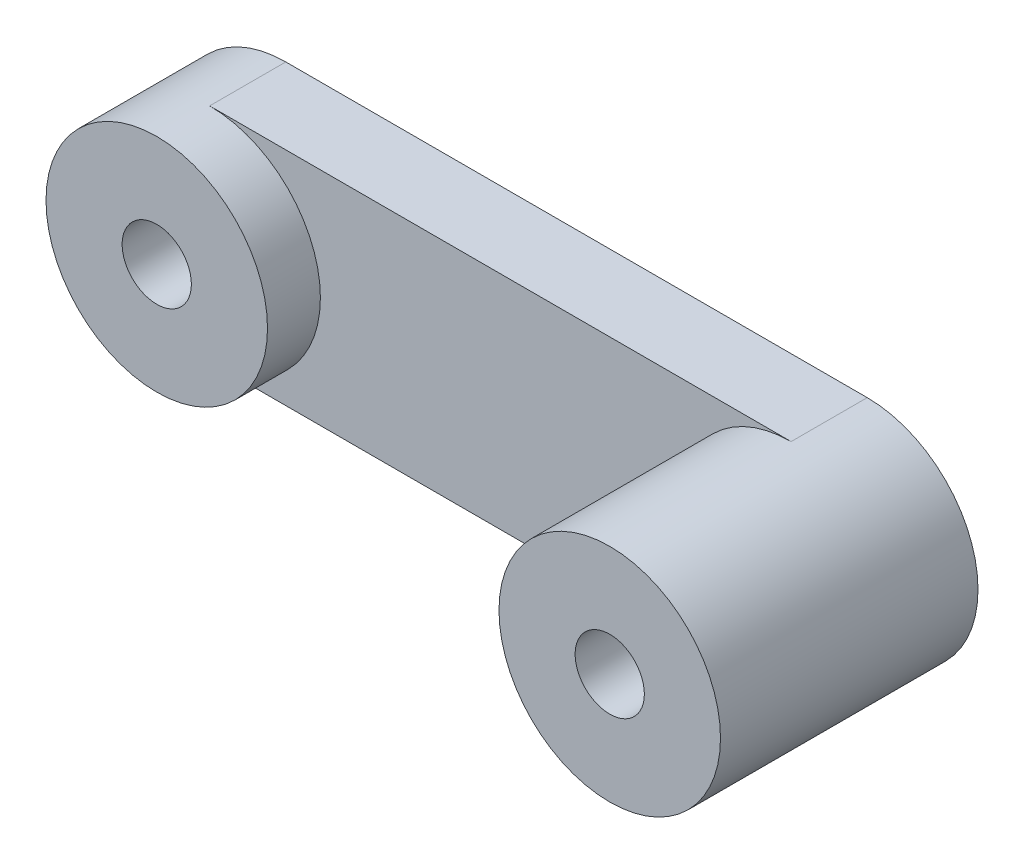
ISO-10303-21;
HEADER;
FILE_DESCRIPTION(('STEP AP214'),'2;1');
FILE_NAME('part.step','',(''),(''),'','','');
FILE_SCHEMA(('AUTOMOTIVE_DESIGN { 1 0 10303 214 1 1 1 1 }'));
ENDSEC;
DATA;
#1=APPLICATION_CONTEXT('core data for automotive mechanical design processes');
#2=APPLICATION_PROTOCOL_DEFINITION('international standard','automotive_design',2000,#1);
#3=PRODUCT_CONTEXT('',#1,'mechanical');
#4=PRODUCT('Part','Part','',(#3));
#5=PRODUCT_RELATED_PRODUCT_CATEGORY('part','',(#4));
#6=PRODUCT_DEFINITION_FORMATION('','',#4);
#7=PRODUCT_DEFINITION_CONTEXT('part definition',#1,'design');
#8=PRODUCT_DEFINITION('design','',#6,#7);
#9=PRODUCT_DEFINITION_SHAPE('','',#8);
#10=(LENGTH_UNIT() NAMED_UNIT(*) SI_UNIT(.MILLI.,.METRE.));
#11=(NAMED_UNIT(*) PLANE_ANGLE_UNIT() SI_UNIT($,.RADIAN.));
#12=(NAMED_UNIT(*) SI_UNIT($,.STERADIAN.) SOLID_ANGLE_UNIT());
#13=UNCERTAINTY_MEASURE_WITH_UNIT(LENGTH_MEASURE(1.E-05),#10,'distance_accuracy_value','');
#14=(GEOMETRIC_REPRESENTATION_CONTEXT(3) GLOBAL_UNCERTAINTY_ASSIGNED_CONTEXT((#13)) GLOBAL_UNIT_ASSIGNED_CONTEXT((#10,
#11,#12)) REPRESENTATION_CONTEXT('',''));
#15=CARTESIAN_POINT('',(0.,0.,0.));
#16=DIRECTION('',(0.,0.,1.));
#17=DIRECTION('',(1.,0.,0.));
#18=AXIS2_PLACEMENT_3D('',#15,#16,#17);
#19=CARTESIAN_POINT('',(0.,0.,2.75));
#20=DIRECTION('',(0.,0.,1.));
#21=DIRECTION('',(1.,0.,0.));
#22=AXIS2_PLACEMENT_3D('',#19,#20,#21);
#23=PLANE('',#22);
#24=DIRECTION('',(-1.,0.,0.));
#25=VECTOR('',#24,1.);
#26=CARTESIAN_POINT('',(0.,4.,2.75));
#27=LINE('',#26,#25);
#28=CARTESIAN_POINT('',(21.,4.00000000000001,2.75));
#29=VERTEX_POINT('',#28);
#30=CARTESIAN_POINT('',(0.,4.,2.75));
#31=VERTEX_POINT('',#30);
#32=EDGE_CURVE('E365',#29,#31,#27,.T.);
#33=ORIENTED_EDGE('',*,*,#32,.T.);
#34=CARTESIAN_POINT('',(0.,0.,2.75));
#35=DIRECTION('',(0.,0.,1.));
#36=DIRECTION('',(1.,0.,0.));
#37=AXIS2_PLACEMENT_3D('',#34,#35,#36);
#38=CIRCLE('',#37,4.);
#39=CARTESIAN_POINT('',(0.,-4.,2.75));
#40=VERTEX_POINT('',#39);
#41=EDGE_CURVE('E393',#40,#31,#38,.T.);
#42=ORIENTED_EDGE('',*,*,#41,.F.);
#43=DIRECTION('',(1.,0.,0.));
#44=VECTOR('',#43,1.);
#45=CARTESIAN_POINT('',(21.,-4.,2.75));
#46=LINE('',#45,#44);
#47=CARTESIAN_POINT('',(21.,-4.,2.75));
#48=VERTEX_POINT('',#47);
#49=EDGE_CURVE('E370',#40,#48,#46,.T.);
#50=ORIENTED_EDGE('',*,*,#49,.T.);
#51=CARTESIAN_POINT('',(21.,0.,2.75));
#52=DIRECTION('',(0.,0.,1.));
#53=DIRECTION('',(1.,0.,0.));
#54=AXIS2_PLACEMENT_3D('',#51,#52,#53);
#55=CIRCLE('',#54,4.00000000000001);
#56=EDGE_CURVE('E413',#29,#48,#55,.T.);
#57=ORIENTED_EDGE('',*,*,#56,.F.);
#58=EDGE_LOOP('',(#33,#42,#50,#57));
#59=FACE_BOUND('',#58,.T.);
#60=ADVANCED_FACE('F348',(#59),#23,.T.);
#61=CARTESIAN_POINT('',(0.,0.,0.));
#62=DIRECTION('',(0.,0.,1.));
#63=DIRECTION('',(1.,0.,0.));
#64=AXIS2_PLACEMENT_3D('',#61,#62,#63);
#65=PLANE('',#64);
#66=CARTESIAN_POINT('',(0.,0.,0.));
#67=DIRECTION('',(0.,0.,1.));
#68=DIRECTION('',(1.,0.,0.));
#69=AXIS2_PLACEMENT_3D('',#66,#67,#68);
#70=CIRCLE('',#69,1.25);
#71=CARTESIAN_POINT('',(1.25,0.,0.));
#72=VERTEX_POINT('',#71);
#73=EDGE_CURVE('E450',#72,#72,#70,.T.);
#74=ORIENTED_EDGE('',*,*,#73,.T.);
#75=EDGE_LOOP('',(#74));
#76=FACE_BOUND('',#75,.T.);
#77=CARTESIAN_POINT('',(0.,0.,0.));
#78=DIRECTION('',(0.,0.,1.));
#79=DIRECTION('',(1.,0.,0.));
#80=AXIS2_PLACEMENT_3D('',#77,#78,#79);
#81=CIRCLE('',#80,4.);
#82=CARTESIAN_POINT('',(0.,4.,0.));
#83=VERTEX_POINT('',#82);
#84=CARTESIAN_POINT('',(0.,-4.,0.));
#85=VERTEX_POINT('',#84);
#86=EDGE_CURVE('E395',#83,#85,#81,.T.);
#87=ORIENTED_EDGE('',*,*,#86,.F.);
#88=DIRECTION('',(-1.,0.,0.));
#89=VECTOR('',#88,1.);
#90=CARTESIAN_POINT('',(0.,4.,0.));
#91=LINE('',#90,#89);
#92=CARTESIAN_POINT('',(21.,4.,0.));
#93=VERTEX_POINT('',#92);
#94=EDGE_CURVE('E400',#93,#83,#91,.T.);
#95=ORIENTED_EDGE('',*,*,#94,.F.);
#96=CARTESIAN_POINT('',(21.,0.,0.));
#97=DIRECTION('',(0.,0.,1.));
#98=DIRECTION('',(-1.,0.,0.));
#99=AXIS2_PLACEMENT_3D('',#96,#97,#98);
#100=CIRCLE('',#99,4.);
#101=CARTESIAN_POINT('',(21.,-4.,0.));
#102=VERTEX_POINT('',#101);
#103=EDGE_CURVE('E439',#102,#93,#100,.T.);
#104=ORIENTED_EDGE('',*,*,#103,.F.);
#105=DIRECTION('',(1.,0.,0.));
#106=VECTOR('',#105,1.);
#107=CARTESIAN_POINT('',(21.,-4.,0.));
#108=LINE('',#107,#106);
#109=EDGE_CURVE('E444',#85,#102,#108,.T.);
#110=ORIENTED_EDGE('',*,*,#109,.F.);
#111=EDGE_LOOP('',(#87,#95,#104,#110));
#112=FACE_BOUND('',#111,.T.);
#113=CARTESIAN_POINT('',(21.,0.,0.));
#114=DIRECTION('',(0.,0.,1.));
#115=DIRECTION('',(1.,0.,0.));
#116=AXIS2_PLACEMENT_3D('',#113,#114,#115);
#117=CIRCLE('',#116,1.25);
#118=CARTESIAN_POINT('',(22.25,0.,0.));
#119=VERTEX_POINT('',#118);
#120=EDGE_CURVE('E417',#119,#119,#117,.T.);
#121=ORIENTED_EDGE('',*,*,#120,.T.);
#122=EDGE_LOOP('',(#121));
#123=FACE_BOUND('',#122,.T.);
#124=ADVANCED_FACE('F442',(#76,#112,#123),#65,.F.);
#125=CARTESIAN_POINT('',(0.,0.,2.75));
#126=DIRECTION('',(0.,0.,-1.));
#127=DIRECTION('',(-1.,0.,0.));
#128=AXIS2_PLACEMENT_3D('',#125,#126,#127);
#129=CYLINDRICAL_SURFACE('',#128,4.);
#130=ORIENTED_EDGE('',*,*,#86,.T.);
#131=DIRECTION('',(0.,0.,-1.));
#132=VECTOR('',#131,1.);
#133=CARTESIAN_POINT('',(0.,-4.,2.75));
#134=LINE('',#133,#132);
#135=EDGE_CURVE('E11',#40,#85,#134,.T.);
#136=ORIENTED_EDGE('',*,*,#135,.F.);
#137=ORIENTED_EDGE('',*,*,#41,.T.);
#138=DIRECTION('',(0.,0.,-1.));
#139=VECTOR('',#138,1.);
#140=CARTESIAN_POINT('',(0.,4.,2.75));
#141=LINE('',#140,#139);
#142=EDGE_CURVE('E425',#31,#83,#141,.T.);
#143=ORIENTED_EDGE('',*,*,#142,.T.);
#144=EDGE_LOOP('',(#130,#136,#137,#143));
#145=FACE_BOUND('',#144,.T.);
#146=CARTESIAN_POINT('',(0.,0.,4.66));
#147=DIRECTION('',(0.,0.,1.));
#148=DIRECTION('',(1.,0.,0.));
#149=AXIS2_PLACEMENT_3D('',#146,#147,#148);
#150=CIRCLE('',#149,4.);
#151=CARTESIAN_POINT('',(4.,0.,4.66));
#152=VERTEX_POINT('',#151);
#153=EDGE_CURVE('E402',#152,#152,#150,.T.);
#154=ORIENTED_EDGE('',*,*,#153,.F.);
#155=EDGE_LOOP('',(#154));
#156=FACE_BOUND('',#155,.T.);
#157=ADVANCED_FACE('F350',(#145,#156),#129,.T.);
#158=CARTESIAN_POINT('',(21.,-4.,2.75));
#159=DIRECTION('',(0.,1.,0.));
#160=DIRECTION('',(-1.,0.,0.));
#161=AXIS2_PLACEMENT_3D('',#158,#159,#160);
#162=PLANE('',#161);
#163=ORIENTED_EDGE('',*,*,#109,.T.);
#164=DIRECTION('',(0.,0.,-1.));
#165=VECTOR('',#164,1.);
#166=CARTESIAN_POINT('',(21.,-4.,2.75));
#167=LINE('',#166,#165);
#168=EDGE_CURVE('E357',#48,#102,#167,.T.);
#169=ORIENTED_EDGE('',*,*,#168,.F.);
#170=ORIENTED_EDGE('',*,*,#49,.F.);
#171=ORIENTED_EDGE('',*,*,#135,.T.);
#172=EDGE_LOOP('',(#163,#169,#170,#171));
#173=FACE_BOUND('',#172,.T.);
#174=ADVANCED_FACE('F397',(#173),#162,.F.);
#175=CARTESIAN_POINT('',(21.,0.,2.75));
#176=DIRECTION('',(0.,0.,-1.));
#177=DIRECTION('',(-1.,0.,0.));
#178=AXIS2_PLACEMENT_3D('',#175,#176,#177);
#179=CYLINDRICAL_SURFACE('',#178,4.);
#180=ORIENTED_EDGE('',*,*,#103,.T.);
#181=DIRECTION('',(0.,0.,-1.));
#182=VECTOR('',#181,1.);
#183=CARTESIAN_POINT('',(21.,4.,2.75));
#184=LINE('',#183,#182);
#185=EDGE_CURVE('E428',#29,#93,#184,.T.);
#186=ORIENTED_EDGE('',*,*,#185,.F.);
#187=ORIENTED_EDGE('',*,*,#56,.T.);
#188=ORIENTED_EDGE('',*,*,#168,.T.);
#189=EDGE_LOOP('',(#180,#186,#187,#188));
#190=FACE_BOUND('',#189,.T.);
#191=CARTESIAN_POINT('',(21.,0.,9.3));
#192=DIRECTION('',(0.,0.,1.));
#193=DIRECTION('',(1.,0.,0.));
#194=AXIS2_PLACEMENT_3D('',#191,#192,#193);
#195=CIRCLE('',#194,4.00000000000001);
#196=CARTESIAN_POINT('',(25.,0.,9.3));
#197=VERTEX_POINT('',#196);
#198=EDGE_CURVE('E414',#197,#197,#195,.T.);
#199=ORIENTED_EDGE('',*,*,#198,.F.);
#200=EDGE_LOOP('',(#199));
#201=FACE_BOUND('',#200,.T.);
#202=ADVANCED_FACE('F436',(#190,#201),#179,.T.);
#203=CARTESIAN_POINT('',(0.,4.,2.75));
#204=DIRECTION('',(0.,-1.,0.));
#205=DIRECTION('',(0.,0.,-1.));
#206=AXIS2_PLACEMENT_3D('',#203,#204,#205);
#207=PLANE('',#206);
#208=ORIENTED_EDGE('',*,*,#94,.T.);
#209=ORIENTED_EDGE('',*,*,#142,.F.);
#210=ORIENTED_EDGE('',*,*,#32,.F.);
#211=ORIENTED_EDGE('',*,*,#185,.T.);
#212=EDGE_LOOP('',(#208,#209,#210,#211));
#213=FACE_BOUND('',#212,.T.);
#214=ADVANCED_FACE('F483',(#213),#207,.F.);
#215=CARTESIAN_POINT('',(0.,0.,2.75));
#216=DIRECTION('',(0.,0.,-1.));
#217=DIRECTION('',(-1.,0.,0.));
#218=AXIS2_PLACEMENT_3D('',#215,#216,#217);
#219=CYLINDRICAL_SURFACE('',#218,1.25);
#220=ORIENTED_EDGE('',*,*,#73,.F.);
#221=EDGE_LOOP('',(#220));
#222=FACE_BOUND('',#221,.T.);
#223=CARTESIAN_POINT('',(0.,0.,4.66));
#224=DIRECTION('',(0.,0.,1.));
#225=DIRECTION('',(1.,0.,0.));
#226=AXIS2_PLACEMENT_3D('',#223,#224,#225);
#227=CIRCLE('',#226,1.25);
#228=CARTESIAN_POINT('',(1.25,0.,4.66));
#229=VERTEX_POINT('',#228);
#230=EDGE_CURVE('E403',#229,#229,#227,.T.);
#231=ORIENTED_EDGE('',*,*,#230,.T.);
#232=EDGE_LOOP('',(#231));
#233=FACE_BOUND('',#232,.T.);
#234=ADVANCED_FACE('F461',(#222,#233),#219,.F.);
#235=CARTESIAN_POINT('',(21.,0.,2.75));
#236=DIRECTION('',(0.,0.,-1.));
#237=DIRECTION('',(-1.,0.,0.));
#238=AXIS2_PLACEMENT_3D('',#235,#236,#237);
#239=CYLINDRICAL_SURFACE('',#238,1.25);
#240=ORIENTED_EDGE('',*,*,#120,.F.);
#241=EDGE_LOOP('',(#240));
#242=FACE_BOUND('',#241,.T.);
#243=CARTESIAN_POINT('',(21.,0.,9.3));
#244=DIRECTION('',(0.,0.,1.));
#245=DIRECTION('',(1.,0.,0.));
#246=AXIS2_PLACEMENT_3D('',#243,#244,#245);
#247=CIRCLE('',#246,1.25);
#248=CARTESIAN_POINT('',(22.25,0.,9.3));
#249=VERTEX_POINT('',#248);
#250=EDGE_CURVE('E406',#249,#249,#247,.T.);
#251=ORIENTED_EDGE('',*,*,#250,.T.);
#252=EDGE_LOOP('',(#251));
#253=FACE_BOUND('',#252,.T.);
#254=ADVANCED_FACE('F457',(#242,#253),#239,.F.);
#255=CARTESIAN_POINT('',(21.,0.,9.3));
#256=DIRECTION('',(0.,0.,1.));
#257=DIRECTION('',(1.,0.,0.));
#258=AXIS2_PLACEMENT_3D('',#255,#256,#257);
#259=PLANE('',#258);
#260=ORIENTED_EDGE('',*,*,#198,.T.);
#261=EDGE_LOOP('',(#260));
#262=FACE_BOUND('',#261,.T.);
#263=ORIENTED_EDGE('',*,*,#250,.F.);
#264=EDGE_LOOP('',(#263));
#265=FACE_BOUND('',#264,.T.);
#266=ADVANCED_FACE('F460',(#262,#265),#259,.T.);
#267=CARTESIAN_POINT('',(0.,0.,4.66));
#268=DIRECTION('',(0.,0.,1.));
#269=DIRECTION('',(1.,0.,0.));
#270=AXIS2_PLACEMENT_3D('',#267,#268,#269);
#271=PLANE('',#270);
#272=ORIENTED_EDGE('',*,*,#153,.T.);
#273=EDGE_LOOP('',(#272));
#274=FACE_BOUND('',#273,.T.);
#275=ORIENTED_EDGE('',*,*,#230,.F.);
#276=EDGE_LOOP('',(#275));
#277=FACE_BOUND('',#276,.T.);
#278=ADVANCED_FACE('F466',(#274,#277),#271,.T.);
#279=CLOSED_SHELL('',(#60,#124,#157,#174,#202,#214,#234,#254,#266,#278));
#280=MANIFOLD_SOLID_BREP('B2',#279);
#281=ADVANCED_BREP_SHAPE_REPRESENTATION('',(#18,#280),#14);
#282=SHAPE_DEFINITION_REPRESENTATION(#9,#281);
ENDSEC;
END-ISO-10303-21;
